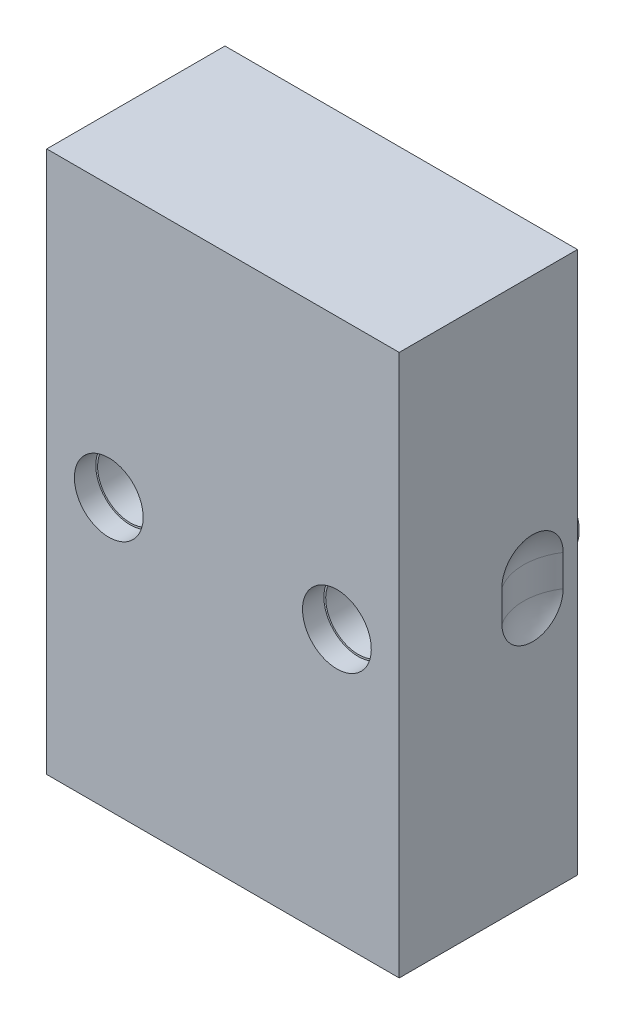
ISO-10303-21;
HEADER;
FILE_DESCRIPTION(('STEP AP214'),'2;1');
FILE_NAME('part.step','',(''),(''),'','','');
FILE_SCHEMA(('AUTOMOTIVE_DESIGN { 1 0 10303 214 1 1 1 1 }'));
ENDSEC;
DATA;
#1=APPLICATION_CONTEXT('core data for automotive mechanical design processes');
#2=APPLICATION_PROTOCOL_DEFINITION('international standard','automotive_design',2000,#1);
#3=PRODUCT_CONTEXT('',#1,'mechanical');
#4=PRODUCT('Part','Part','',(#3));
#5=PRODUCT_RELATED_PRODUCT_CATEGORY('part','',(#4));
#6=PRODUCT_DEFINITION_FORMATION('','',#4);
#7=PRODUCT_DEFINITION_CONTEXT('part definition',#1,'design');
#8=PRODUCT_DEFINITION('design','',#6,#7);
#9=PRODUCT_DEFINITION_SHAPE('','',#8);
#10=(LENGTH_UNIT() NAMED_UNIT(*) SI_UNIT(.MILLI.,.METRE.));
#11=(NAMED_UNIT(*) PLANE_ANGLE_UNIT() SI_UNIT($,.RADIAN.));
#12=(NAMED_UNIT(*) SI_UNIT($,.STERADIAN.) SOLID_ANGLE_UNIT());
#13=UNCERTAINTY_MEASURE_WITH_UNIT(LENGTH_MEASURE(1.E-05),#10,'distance_accuracy_value','');
#14=(GEOMETRIC_REPRESENTATION_CONTEXT(3) GLOBAL_UNCERTAINTY_ASSIGNED_CONTEXT((#13)) GLOBAL_UNIT_ASSIGNED_CONTEXT((#10,
#11,#12)) REPRESENTATION_CONTEXT('',''));
#15=CARTESIAN_POINT('',(0.,0.,0.));
#16=DIRECTION('',(0.,0.,1.));
#17=DIRECTION('',(1.,0.,0.));
#18=AXIS2_PLACEMENT_3D('',#15,#16,#17);
#19=CARTESIAN_POINT('',(31.9999999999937,6.98303303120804E-12,7.));
#20=DIRECTION('',(0.,0.,-1.));
#21=DIRECTION('',(0.,1.,0.));
#22=AXIS2_PLACEMENT_3D('',#19,#20,#21);
#23=CYLINDRICAL_SURFACE('',#22,2.6);
#24=CARTESIAN_POINT('',(31.9999999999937,6.98308201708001E-12,6.59999999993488));
#25=DIRECTION('',(0.,0.,1.));
#26=DIRECTION('',(0.,-1.,0.));
#27=AXIS2_PLACEMENT_3D('',#24,#25,#26);
#28=CIRCLE('',#27,2.59999999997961);
#29=CARTESIAN_POINT('',(31.9999999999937,-2.59999999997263,6.59999999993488));
#30=VERTEX_POINT('',#29);
#31=EDGE_CURVE('E142',#30,#30,#28,.T.);
#32=ORIENTED_EDGE('',*,*,#31,.T.);
#33=EDGE_LOOP('',(#32));
#34=FACE_BOUND('',#33,.T.);
#35=CARTESIAN_POINT('',(31.9999999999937,6.98389028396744E-12,0.));
#36=DIRECTION('',(0.,0.,-1.));
#37=DIRECTION('',(0.,1.,0.));
#38=AXIS2_PLACEMENT_3D('',#35,#36,#37);
#39=CIRCLE('',#38,2.6);
#40=CARTESIAN_POINT('',(31.9999999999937,2.60000000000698,0.));
#41=VERTEX_POINT('',#40);
#42=EDGE_CURVE('E18',#41,#41,#39,.F.);
#43=ORIENTED_EDGE('',*,*,#42,.F.);
#44=EDGE_LOOP('',(#43));
#45=FACE_BOUND('',#44,.T.);
#46=ADVANCED_FACE('F14',(#34,#45),#23,.F.);
#47=CARTESIAN_POINT('',(-6.23323614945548E-12,5.54116962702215E-12,7.));
#48=DIRECTION('',(0.,0.,-1.));
#49=DIRECTION('',(0.,1.,0.));
#50=AXIS2_PLACEMENT_3D('',#47,#48,#49);
#51=CYLINDRICAL_SURFACE('',#50,2.6);
#52=CARTESIAN_POINT('',(-6.23323614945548E-12,5.54121861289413E-12,6.59999999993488));
#53=DIRECTION('',(0.,0.,1.));
#54=DIRECTION('',(0.,-1.,0.));
#55=AXIS2_PLACEMENT_3D('',#52,#53,#54);
#56=CIRCLE('',#55,2.59999999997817);
#57=CARTESIAN_POINT('',(-6.23339535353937E-12,-2.59999999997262,6.59999999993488));
#58=VERTEX_POINT('',#57);
#59=EDGE_CURVE('E145',#58,#58,#56,.T.);
#60=ORIENTED_EDGE('',*,*,#59,.T.);
#61=EDGE_LOOP('',(#60));
#62=FACE_BOUND('',#61,.T.);
#63=CARTESIAN_POINT('',(-6.23323614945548E-12,5.54202687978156E-12,0.));
#64=DIRECTION('',(0.,0.,-1.));
#65=DIRECTION('',(0.,1.,0.));
#66=AXIS2_PLACEMENT_3D('',#63,#64,#65);
#67=CIRCLE('',#66,2.6);
#68=CARTESIAN_POINT('',(-6.23323614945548E-12,2.60000000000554,0.));
#69=VERTEX_POINT('',#68);
#70=EDGE_CURVE('E246',#69,#69,#67,.F.);
#71=ORIENTED_EDGE('',*,*,#70,.F.);
#72=EDGE_LOOP('',(#71));
#73=FACE_BOUND('',#72,.T.);
#74=ADVANCED_FACE('F256',(#62,#73),#51,.F.);
#75=CARTESIAN_POINT('',(-6.23323614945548E-12,5.54114046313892E-12,6.99999999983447));
#76=DIRECTION('',(0.,0.,1.));
#77=DIRECTION('',(0.,-1.,0.));
#78=AXIS2_PLACEMENT_3D('',#75,#76,#77);
#79=CONICAL_SURFACE('',#78,2.9999999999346,0.785398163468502);
#80=CARTESIAN_POINT('',(-6.23323614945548E-12,5.5411404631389E-12,6.99999999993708));
#81=DIRECTION('',(0.,0.,1.));
#82=DIRECTION('',(0.,-1.,0.));
#83=AXIS2_PLACEMENT_3D('',#80,#81,#82);
#84=CIRCLE('',#83,3.0000000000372);
#85=CARTESIAN_POINT('',(-6.23323614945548E-12,-3.00000000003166,6.99999999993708));
#86=VERTEX_POINT('',#85);
#87=EDGE_CURVE('E244',#86,#86,#84,.T.);
#88=ORIENTED_EDGE('',*,*,#87,.T.);
#89=EDGE_LOOP('',(#88));
#90=FACE_BOUND('',#89,.T.);
#91=ORIENTED_EDGE('',*,*,#59,.F.);
#92=EDGE_LOOP('',(#91));
#93=FACE_BOUND('',#92,.T.);
#94=ADVANCED_FACE('F263',(#90,#93),#79,.F.);
#95=CARTESIAN_POINT('',(31.9999999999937,6.98312935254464E-12,6.99999999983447));
#96=DIRECTION('',(0.,0.,1.));
#97=DIRECTION('',(0.,-1.,0.));
#98=AXIS2_PLACEMENT_3D('',#95,#96,#97);
#99=CONICAL_SURFACE('',#98,2.99999999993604,0.785398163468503);
#100=CARTESIAN_POINT('',(31.9999999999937,6.98312935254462E-12,6.99999999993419));
#101=DIRECTION('',(0.,0.,1.));
#102=DIRECTION('',(0.,-1.,0.));
#103=AXIS2_PLACEMENT_3D('',#100,#101,#102);
#104=CIRCLE('',#103,3.00000000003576);
#105=CARTESIAN_POINT('',(31.9999999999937,-3.00000000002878,6.99999999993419));
#106=VERTEX_POINT('',#105);
#107=EDGE_CURVE('E241',#106,#106,#104,.T.);
#108=ORIENTED_EDGE('',*,*,#107,.T.);
#109=EDGE_LOOP('',(#108));
#110=FACE_BOUND('',#109,.T.);
#111=ORIENTED_EDGE('',*,*,#31,.F.);
#112=EDGE_LOOP('',(#111));
#113=FACE_BOUND('',#112,.T.);
#114=ADVANCED_FACE('F269',(#110,#113),#99,.F.);
#115=CARTESIAN_POINT('',(29.4,0.,0.));
#116=DIRECTION('',(0.,0.,-1.));
#117=DIRECTION('',(0.,1.,0.));
#118=AXIS2_PLACEMENT_3D('',#115,#116,#117);
#119=PLANE('',#118);
#120=CARTESIAN_POINT('',(32.,0.,0.));
#121=DIRECTION('',(0.,0.,-1.));
#122=DIRECTION('',(0.,1.,0.));
#123=AXIS2_PLACEMENT_3D('',#120,#121,#122);
#124=CIRCLE('',#123,5.);
#125=CARTESIAN_POINT('',(32.,5.00000000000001,0.));
#126=VERTEX_POINT('',#125);
#127=EDGE_CURVE('E238',#126,#126,#124,.F.);
#128=ORIENTED_EDGE('',*,*,#127,.F.);
#129=EDGE_LOOP('',(#128));
#130=FACE_BOUND('',#129,.T.);
#131=ORIENTED_EDGE('',*,*,#42,.T.);
#132=EDGE_LOOP('',(#131));
#133=FACE_BOUND('',#132,.T.);
#134=ADVANCED_FACE('F253',(#130,#133),#119,.T.);
#135=CARTESIAN_POINT('',(-2.60000000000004,0.,0.));
#136=DIRECTION('',(0.,0.,-1.));
#137=DIRECTION('',(0.,1.,0.));
#138=AXIS2_PLACEMENT_3D('',#135,#136,#137);
#139=PLANE('',#138);
#140=CARTESIAN_POINT('',(0.,0.,6.51909082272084E-12));
#141=DIRECTION('',(0.,0.,-1.));
#142=DIRECTION('',(0.,1.,0.));
#143=AXIS2_PLACEMENT_3D('',#140,#141,#142);
#144=CIRCLE('',#143,5.);
#145=CARTESIAN_POINT('',(0.,5.00000000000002,6.51970314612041E-12));
#146=VERTEX_POINT('',#145);
#147=EDGE_CURVE('E235',#146,#146,#144,.F.);
#148=ORIENTED_EDGE('',*,*,#147,.F.);
#149=EDGE_LOOP('',(#148));
#150=FACE_BOUND('',#149,.T.);
#151=ORIENTED_EDGE('',*,*,#70,.T.);
#152=EDGE_LOOP('',(#151));
#153=FACE_BOUND('',#152,.T.);
#154=ADVANCED_FACE('F276',(#150,#153),#139,.T.);
#155=CARTESIAN_POINT('',(-3.34487992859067E-12,2.65352394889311E-12,7.));
#156=DIRECTION('',(0.,0.,-1.));
#157=DIRECTION('',(0.,1.,0.));
#158=AXIS2_PLACEMENT_3D('',#155,#156,#157);
#159=PLANE('',#158);
#160=CARTESIAN_POINT('',(-3.34487992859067E-12,2.65352394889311E-12,7.));
#161=DIRECTION('',(0.,0.,1.));
#162=DIRECTION('',(0.,-1.,0.));
#163=AXIS2_PLACEMENT_3D('',#160,#161,#162);
#164=CIRCLE('',#163,4.57);
#165=CARTESIAN_POINT('',(-3.34487992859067E-12,-4.56999999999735,7.));
#166=VERTEX_POINT('',#165);
#167=EDGE_CURVE('E232',#166,#166,#164,.T.);
#168=ORIENTED_EDGE('',*,*,#167,.T.);
#169=EDGE_LOOP('',(#168));
#170=FACE_BOUND('',#169,.T.);
#171=ORIENTED_EDGE('',*,*,#87,.F.);
#172=EDGE_LOOP('',(#171));
#173=FACE_BOUND('',#172,.T.);
#174=ADVANCED_FACE('F280',(#170,#173),#159,.F.);
#175=CARTESIAN_POINT('',(31.9999999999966,2.65156451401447E-12,7.));
#176=DIRECTION('',(0.,0.,-1.));
#177=DIRECTION('',(0.,1.,0.));
#178=AXIS2_PLACEMENT_3D('',#175,#176,#177);
#179=PLANE('',#178);
#180=CARTESIAN_POINT('',(31.9999999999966,2.65156451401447E-12,7.));
#181=DIRECTION('',(0.,0.,1.));
#182=DIRECTION('',(0.,-1.,0.));
#183=AXIS2_PLACEMENT_3D('',#180,#181,#182);
#184=CIRCLE('',#183,4.57);
#185=CARTESIAN_POINT('',(31.9999999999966,-4.56999999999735,7.));
#186=VERTEX_POINT('',#185);
#187=EDGE_CURVE('E81',#186,#186,#184,.T.);
#188=ORIENTED_EDGE('',*,*,#187,.T.);
#189=EDGE_LOOP('',(#188));
#190=FACE_BOUND('',#189,.T.);
#191=ORIENTED_EDGE('',*,*,#107,.F.);
#192=EDGE_LOOP('',(#191));
#193=FACE_BOUND('',#192,.T.);
#194=ADVANCED_FACE('F284',(#190,#193),#179,.F.);
#195=CARTESIAN_POINT('',(32.,0.,4.));
#196=DIRECTION('',(0.,0.,-1.));
#197=DIRECTION('',(0.,1.,0.));
#198=AXIS2_PLACEMENT_3D('',#195,#196,#197);
#199=CYLINDRICAL_SURFACE('',#198,5.);
#200=CARTESIAN_POINT('',(32.,0.,4.00000000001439));
#201=DIRECTION('',(0.,0.,-1.));
#202=DIRECTION('',(0.,1.,0.));
#203=AXIS2_PLACEMENT_3D('',#200,#201,#202);
#204=CIRCLE('',#203,5.);
#205=CARTESIAN_POINT('',(32.,5.00000000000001,4.00000000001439));
#206=VERTEX_POINT('',#205);
#207=EDGE_CURVE('E221',#206,#206,#204,.F.);
#208=ORIENTED_EDGE('',*,*,#207,.F.);
#209=EDGE_LOOP('',(#208));
#210=FACE_BOUND('',#209,.T.);
#211=ORIENTED_EDGE('',*,*,#127,.T.);
#212=EDGE_LOOP('',(#211));
#213=FACE_BOUND('',#212,.T.);
#214=ADVANCED_FACE('F288',(#210,#213),#199,.T.);
#215=CARTESIAN_POINT('',(0.,0.,4.));
#216=DIRECTION('',(0.,0.,-1.));
#217=DIRECTION('',(0.,1.,0.));
#218=AXIS2_PLACEMENT_3D('',#215,#216,#217);
#219=CYLINDRICAL_SURFACE('',#218,5.);
#220=CARTESIAN_POINT('',(0.,0.,3.99999999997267));
#221=DIRECTION('',(0.,0.,-1.));
#222=DIRECTION('',(0.,1.,0.));
#223=AXIS2_PLACEMENT_3D('',#220,#221,#222);
#224=CIRCLE('',#223,5.);
#225=CARTESIAN_POINT('',(0.,5.00000000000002,3.99999999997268));
#226=VERTEX_POINT('',#225);
#227=EDGE_CURVE('E211',#226,#226,#224,.F.);
#228=ORIENTED_EDGE('',*,*,#227,.F.);
#229=EDGE_LOOP('',(#228));
#230=FACE_BOUND('',#229,.T.);
#231=ORIENTED_EDGE('',*,*,#147,.T.);
#232=EDGE_LOOP('',(#231));
#233=FACE_BOUND('',#232,.T.);
#234=ADVANCED_FACE('F292',(#230,#233),#219,.T.);
#235=CARTESIAN_POINT('',(-3.34487992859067E-12,2.65156451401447E-12,23.));
#236=DIRECTION('',(0.,0.,1.));
#237=DIRECTION('',(0.,-1.,0.));
#238=AXIS2_PLACEMENT_3D('',#235,#236,#237);
#239=CYLINDRICAL_SURFACE('',#238,4.57);
#240=ORIENTED_EDGE('',*,*,#167,.F.);
#241=EDGE_LOOP('',(#240));
#242=FACE_BOUND('',#241,.T.);
#243=CARTESIAN_POINT('',(-3.34487992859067E-12,2.65119712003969E-12,25.9999994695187));
#244=DIRECTION('',(0.,0.,1.));
#245=DIRECTION('',(0.,-1.,0.));
#246=AXIS2_PLACEMENT_3D('',#243,#244,#245);
#247=CIRCLE('',#246,4.57);
#248=CARTESIAN_POINT('',(-3.34487992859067E-12,-4.56999999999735,25.9999994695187));
#249=VERTEX_POINT('',#248);
#250=EDGE_CURVE('E208',#249,#249,#247,.T.);
#251=ORIENTED_EDGE('',*,*,#250,.T.);
#252=EDGE_LOOP('',(#251));
#253=FACE_BOUND('',#252,.T.);
#254=ADVANCED_FACE('F296',(#242,#253),#239,.F.);
#255=CARTESIAN_POINT('',(31.9999999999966,2.64960507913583E-12,23.));
#256=DIRECTION('',(0.,0.,1.));
#257=DIRECTION('',(0.,-1.,0.));
#258=AXIS2_PLACEMENT_3D('',#255,#256,#257);
#259=CYLINDRICAL_SURFACE('',#258,4.57);
#260=ORIENTED_EDGE('',*,*,#187,.F.);
#261=EDGE_LOOP('',(#260));
#262=FACE_BOUND('',#261,.T.);
#263=CARTESIAN_POINT('',(31.9999999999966,2.64923768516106E-12,25.9999994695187));
#264=DIRECTION('',(0.,0.,1.));
#265=DIRECTION('',(0.,-1.,0.));
#266=AXIS2_PLACEMENT_3D('',#263,#264,#265);
#267=CIRCLE('',#266,4.57);
#268=CARTESIAN_POINT('',(31.9999999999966,-4.56999999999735,25.9999994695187));
#269=VERTEX_POINT('',#268);
#270=EDGE_CURVE('E96',#269,#269,#267,.T.);
#271=ORIENTED_EDGE('',*,*,#270,.T.);
#272=EDGE_LOOP('',(#271));
#273=FACE_BOUND('',#272,.T.);
#274=ADVANCED_FACE('F300',(#262,#273),#259,.F.);
#275=CARTESIAN_POINT('',(-15.33,-2.20429583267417,10.2999993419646));
#276=DIRECTION('',(0.356578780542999,0.367960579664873,0.858752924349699));
#277=DIRECTION('',(0.818072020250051,-0.56691537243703,-0.0967736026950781));
#278=AXIS2_PLACEMENT_3D('',#275,#276,#277);
#279=SPHERICAL_SURFACE('',#278,7.9);
#280=CARTESIAN_POINT('',(-15.33,-2.20429583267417,10.2999993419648));
#281=DIRECTION('',(0.,-1.,0.));
#282=DIRECTION('',(0.,0.,-1.));
#283=AXIS2_PLACEMENT_3D('',#280,#281,#282);
#284=CIRCLE('',#283,7.9);
#285=CARTESIAN_POINT('',(-8.7,-2.20429583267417,14.5957065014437));
#286=VERTEX_POINT('',#285);
#287=CARTESIAN_POINT('',(-8.7,-2.20429583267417,6.0042921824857));
#288=VERTEX_POINT('',#287);
#289=EDGE_CURVE('E73',#286,#288,#284,.F.);
#290=ORIENTED_EDGE('',*,*,#289,.T.);
#291=CARTESIAN_POINT('',(-8.7,-2.20429583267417,6.0042921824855));
#292=CARTESIAN_POINT('',(-8.7,-2.32511395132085,6.00427919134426));
#293=CARTESIAN_POINT('',(-8.7,-2.44593020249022,6.00938870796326));
#294=CARTESIAN_POINT('',(-8.7,-2.68669834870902,6.0297589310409));
#295=CARTESIAN_POINT('',(-8.7,-2.80665028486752,6.04501915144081));
#296=CARTESIAN_POINT('',(-8.7,-3.04475719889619,6.08558271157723));
#297=CARTESIAN_POINT('',(-8.7,-3.16291338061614,6.11087898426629));
#298=CARTESIAN_POINT('',(-8.7,-3.39667451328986,6.17133061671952));
#299=CARTESIAN_POINT('',(-8.7,-3.51227949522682,6.20648585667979));
#300=CARTESIAN_POINT('',(-8.7,-3.74015097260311,6.28641834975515));
#301=CARTESIAN_POINT('',(-8.69999999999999,-3.85241650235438,6.33119835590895));
#302=CARTESIAN_POINT('',(-8.70000000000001,-4.07281728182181,6.43007414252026));
#303=CARTESIAN_POINT('',(-8.70000000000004,-4.18095099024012,6.48417335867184));
#304=CARTESIAN_POINT('',(-8.69999999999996,-4.39221521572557,6.60125821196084));
#305=CARTESIAN_POINT('',(-8.69999999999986,-4.49534852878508,6.66423880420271));
#306=CARTESIAN_POINT('',(-8.70000000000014,-4.69598170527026,6.79868682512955));
#307=CARTESIAN_POINT('',(-8.70000000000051,-4.79347947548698,6.87015737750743));
#308=CARTESIAN_POINT('',(-8.70000000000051,-4.98207424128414,7.02103229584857));
#309=CARTESIAN_POINT('',(-8.70000000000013,-5.0731734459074,7.10043390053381));
#310=CARTESIAN_POINT('',(-8.69999999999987,-5.24839335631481,7.26665815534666));
#311=CARTESIAN_POINT('',(-8.69999999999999,-5.33251147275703,7.35348353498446));
#312=CARTESIAN_POINT('',(-8.7,-5.49311603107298,7.53389306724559));
#313=CARTESIAN_POINT('',(-8.69999999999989,-5.56960412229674,7.62747575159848));
#314=CARTESIAN_POINT('',(-8.70000000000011,-5.71445248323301,7.82078712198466));
#315=CARTESIAN_POINT('',(-8.70000000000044,-5.78280974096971,7.92051806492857));
#316=CARTESIAN_POINT('',(-8.70000000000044,-5.91085088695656,8.12534291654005));
#317=CARTESIAN_POINT('',(-8.70000000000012,-5.97053834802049,8.23043459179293));
#318=CARTESIAN_POINT('',(-8.69999999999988,-6.08086973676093,8.44531165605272));
#319=CARTESIAN_POINT('',(-8.69999999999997,-6.13151031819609,8.5550987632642));
#320=CARTESIAN_POINT('',(-8.70000000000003,-6.22334078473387,8.77850114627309));
#321=CARTESIAN_POINT('',(-8.70000000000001,-6.26453474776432,8.89211474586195));
#322=CARTESIAN_POINT('',(-8.69999999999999,-6.33722068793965,9.12245023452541));
#323=CARTESIAN_POINT('',(-8.7,-6.36870908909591,9.23917325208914));
#324=CARTESIAN_POINT('',(-8.7,-6.42173046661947,9.47481749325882));
#325=CARTESIAN_POINT('',(-8.7,-6.44326679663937,9.59373796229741));
#326=CARTESIAN_POINT('',(-8.7,-6.47625238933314,9.83301192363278));
#327=CARTESIAN_POINT('',(-8.7,-6.48769814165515,9.95336589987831));
#328=CARTESIAN_POINT('',(-8.7,-6.50040744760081,10.194592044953));
#329=CARTESIAN_POINT('',(-8.7,-6.5016725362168,10.3154641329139));
#330=CARTESIAN_POINT('',(-8.7,-6.49401556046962,10.5568852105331));
#331=CARTESIAN_POINT('',(-8.7,-6.48509349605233,10.6774342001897));
#332=CARTESIAN_POINT('',(-8.7,-6.45712333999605,10.9173717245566));
#333=CARTESIAN_POINT('',(-8.7,-6.43807358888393,11.0367600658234));
#334=CARTESIAN_POINT('',(-8.7,-6.38999089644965,11.2734659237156));
#335=CARTESIAN_POINT('',(-8.7,-6.36096142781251,11.3907841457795));
#336=CARTESIAN_POINT('',(-8.7,-6.29311212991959,11.6225997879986));
#337=CARTESIAN_POINT('',(-8.7,-6.25428883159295,11.7370961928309));
#338=CARTESIAN_POINT('',(-8.7,-6.16714916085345,11.9623691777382));
#339=CARTESIAN_POINT('',(-8.7,-6.11883628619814,12.0731471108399));
#340=CARTESIAN_POINT('',(-8.7,-6.01303082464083,12.2902830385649));
#341=CARTESIAN_POINT('',(-8.7,-5.95553462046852,12.3966392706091));
#342=CARTESIAN_POINT('',(-8.7,-5.83180799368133,12.6040905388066));
#343=CARTESIAN_POINT('',(-8.7,-5.76558080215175,12.7051875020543));
#344=CARTESIAN_POINT('',(-8.7,-5.62482392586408,12.9014753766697));
#345=CARTESIAN_POINT('',(-8.7,-5.55029159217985,12.9966643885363));
#346=CARTESIAN_POINT('',(-8.7,-5.39350072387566,13.1803901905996));
#347=CARTESIAN_POINT('',(-8.7,-5.31124505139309,13.2689294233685));
#348=CARTESIAN_POINT('',(-8.7,-5.13954860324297,13.4387852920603));
#349=CARTESIAN_POINT('',(-8.7,-5.0501061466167,13.5201002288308));
#350=CARTESIAN_POINT('',(-8.7,-4.86472313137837,13.6748774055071));
#351=CARTESIAN_POINT('',(-8.7,-4.76878498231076,13.7483425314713));
#352=CARTESIAN_POINT('',(-8.7,-4.57099465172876,13.8869802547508));
#353=CARTESIAN_POINT('',(-8.7,-4.46913844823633,13.9521471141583));
#354=CARTESIAN_POINT('',(-8.7,-4.26033524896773,14.0736430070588));
#355=CARTESIAN_POINT('',(-8.7,-4.15339014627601,14.1299752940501));
#356=CARTESIAN_POINT('',(-8.7,-3.93502758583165,14.2334813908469));
#357=CARTESIAN_POINT('',(-8.7,-3.82360584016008,14.2806461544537));
#358=CARTESIAN_POINT('',(-8.7,-3.59722389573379,14.3653963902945));
#359=CARTESIAN_POINT('',(-8.7,-3.48226504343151,14.4029854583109));
#360=CARTESIAN_POINT('',(-8.7,-3.24971945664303,14.468303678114));
#361=CARTESIAN_POINT('',(-8.7,-3.13213575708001,14.496043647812));
#362=CARTESIAN_POINT('',(-8.7,-2.89509682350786,14.5415140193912));
#363=CARTESIAN_POINT('',(-8.7,-2.77564253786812,14.5592493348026));
#364=CARTESIAN_POINT('',(-8.7,-2.58065620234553,14.5798529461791));
#365=CARTESIAN_POINT('',(-8.7,-2.50543627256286,14.5858018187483));
#366=CARTESIAN_POINT('',(-8.7,-2.35491211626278,14.5937257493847));
#367=CARTESIAN_POINT('',(-8.7,-2.27960823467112,14.5957073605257));
#368=CARTESIAN_POINT('',(-8.7,-2.20429583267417,14.5957065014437));
#369=B_SPLINE_CURVE_WITH_KNOTS('',3,(#291,#292,#293,#294,#295,#296,#297,#298,#299,#300,#301,
#302,#303,#304,#305,#306,#307,#308,#309,#310,#311,#312,#313,#314,#315,#316,#317,#318,#319,#320,
#321,#322,#323,#324,#325,#326,#327,#328,#329,#330,#331,#332,#333,#334,#335,#336,#337,#338,#339,
#340,#341,#342,#343,#344,#345,#346,#347,#348,#349,#350,#351,#352,#353,#354,#355,#356,#357,#358,
#359,#360,#361,#362,#363,#364,#365,#366,#367,#368),.UNSPECIFIED.,.F.,.F.,(4,2,2,2,2,2,2,2,2,2,2,
2,2,2,2,2,2,2,2,2,2,2,2,2,2,2,2,2,2,2,2,2,2,2,2,2,2,2,4),(0.,0.362343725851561,
0.724670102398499,1.0867417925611,1.4488090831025,1.81098007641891,2.17328487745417,
2.53538470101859,2.89761816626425,3.25972595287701,3.62196745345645,3.98413047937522,
4.34642724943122,4.70857429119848,5.07085500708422,5.43297903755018,5.79523633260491,
6.15737146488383,6.51963252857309,6.88183897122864,7.24404541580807,7.60631122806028,
7.96845110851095,8.33071944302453,8.69285449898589,9.0551325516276,9.41727691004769,
9.77953710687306,10.1416635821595,10.503875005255,10.86595279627,11.2282796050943,
11.5904726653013,11.9530213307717,12.3154336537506,12.6774466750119,13.0392817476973,
13.2655500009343,13.4914441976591),.UNSPECIFIED.);
#370=EDGE_CURVE('E79',#288,#286,#369,.T.);
#371=ORIENTED_EDGE('',*,*,#370,.T.);
#372=EDGE_LOOP('',(#290,#371));
#373=FACE_BOUND('',#372,.T.);
#374=ADVANCED_FACE('F78',(#373),#279,.F.);
#375=CARTESIAN_POINT('',(-15.33,-26.004661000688,10.2999993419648));
#376=DIRECTION('',(0.,-1.,0.));
#377=DIRECTION('',(0.,0.,-1.));
#378=AXIS2_PLACEMENT_3D('',#375,#376,#377);
#379=CYLINDRICAL_SURFACE('',#378,7.9);
#380=DIRECTION('',(0.,1.,0.));
#381=VECTOR('',#380,1.);
#382=CARTESIAN_POINT('',(-8.7,1.00135803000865E-06,14.5957065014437));
#383=LINE('',#382,#381);
#384=CARTESIAN_POINT('',(-8.7,2.20428984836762,14.5957065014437));
#385=VERTEX_POINT('',#384);
#386=EDGE_CURVE('E89',#286,#385,#383,.T.);
#387=ORIENTED_EDGE('',*,*,#386,.T.);
#388=CARTESIAN_POINT('',(-15.33,2.20428984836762,10.2999993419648));
#389=DIRECTION('',(0.,-1.,0.));
#390=DIRECTION('',(0.,0.,-1.));
#391=AXIS2_PLACEMENT_3D('',#388,#389,#390);
#392=CIRCLE('',#391,7.9);
#393=CARTESIAN_POINT('',(-8.7,2.20428984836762,6.0042921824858));
#394=VERTEX_POINT('',#393);
#395=EDGE_CURVE('E80',#385,#394,#392,.F.);
#396=ORIENTED_EDGE('',*,*,#395,.T.);
#397=DIRECTION('',(0.,1.,0.));
#398=VECTOR('',#397,1.);
#399=CARTESIAN_POINT('',(-8.7,1.00135803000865E-06,6.00429218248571));
#400=LINE('',#399,#398);
#401=EDGE_CURVE('E87',#394,#288,#400,.F.);
#402=ORIENTED_EDGE('',*,*,#401,.T.);
#403=ORIENTED_EDGE('',*,*,#289,.F.);
#404=EDGE_LOOP('',(#387,#396,#402,#403));
#405=FACE_BOUND('',#404,.T.);
#406=ADVANCED_FACE('F91',(#405),#379,.F.);
#407=CARTESIAN_POINT('',(-15.33,2.20428984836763,10.2999993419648));
#408=DIRECTION('',(0.356578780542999,0.367960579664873,0.858752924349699));
#409=DIRECTION('',(0.818072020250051,-0.56691537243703,-0.0967736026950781));
#410=AXIS2_PLACEMENT_3D('',#407,#408,#409);
#411=SPHERICAL_SURFACE('',#410,7.9);
#412=ORIENTED_EDGE('',*,*,#395,.F.);
#413=CARTESIAN_POINT('',(-8.7,2.20428984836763,14.5957065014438));
#414=CARTESIAN_POINT('',(-8.7,2.32510796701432,14.5957194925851));
#415=CARTESIAN_POINT('',(-8.7,2.4459242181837,14.5906099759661));
#416=CARTESIAN_POINT('',(-8.7,2.68669236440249,14.5702397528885));
#417=CARTESIAN_POINT('',(-8.7,2.80664430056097,14.5549795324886));
#418=CARTESIAN_POINT('',(-8.7,3.04475121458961,14.5144159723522));
#419=CARTESIAN_POINT('',(-8.7,3.16290739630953,14.4891196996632));
#420=CARTESIAN_POINT('',(-8.7,3.39666852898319,14.4286680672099));
#421=CARTESIAN_POINT('',(-8.7,3.51227351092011,14.3935128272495));
#422=CARTESIAN_POINT('',(-8.7,3.7401449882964,14.3135803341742));
#423=CARTESIAN_POINT('',(-8.7,3.85241051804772,14.2688003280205));
#424=CARTESIAN_POINT('',(-8.7,4.07281129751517,14.1699245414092));
#425=CARTESIAN_POINT('',(-8.7,4.18094500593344,14.1158253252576));
#426=CARTESIAN_POINT('',(-8.7,4.39220923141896,13.9987404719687));
#427=CARTESIAN_POINT('',(-8.7,4.49534254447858,13.9357598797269));
#428=CARTESIAN_POINT('',(-8.7,4.69597572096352,13.8013118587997));
#429=CARTESIAN_POINT('',(-8.7,4.79347349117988,13.7298413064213));
#430=CARTESIAN_POINT('',(-8.7,4.98206825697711,13.5789663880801));
#431=CARTESIAN_POINT('',(-8.7,5.0731674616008,13.4995647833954));
#432=CARTESIAN_POINT('',(-8.7,5.24838737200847,13.3333405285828));
#433=CARTESIAN_POINT('',(-8.7,5.33250548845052,13.2465151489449));
#434=CARTESIAN_POINT('',(-8.7,5.49311004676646,13.0661056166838));
#435=CARTESIAN_POINT('',(-8.7,5.56959813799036,12.972522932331));
#436=CARTESIAN_POINT('',(-8.7,5.71444649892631,12.7792115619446));
#437=CARTESIAN_POINT('',(-8.7,5.78280375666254,12.6794806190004));
#438=CARTESIAN_POINT('',(-8.7,5.91084490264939,12.4746557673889));
#439=CARTESIAN_POINT('',(-8.7,5.97053236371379,12.3695640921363));
#440=CARTESIAN_POINT('',(-8.7,6.08086375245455,12.1546870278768));
#441=CARTESIAN_POINT('',(-8.7,6.13150433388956,12.0448999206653));
#442=CARTESIAN_POINT('',(-8.7,6.22333480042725,11.8214975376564));
#443=CARTESIAN_POINT('',(-8.7,6.26452876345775,11.7078839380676));
#444=CARTESIAN_POINT('',(-8.7,6.33721470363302,11.4775484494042));
#445=CARTESIAN_POINT('',(-8.7,6.36870310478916,11.3608254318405));
#446=CARTESIAN_POINT('',(-8.7,6.42172448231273,11.1251811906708));
#447=CARTESIAN_POINT('',(-8.7,6.44326081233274,11.0062607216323));
#448=CARTESIAN_POINT('',(-8.7,6.47624640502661,10.7669867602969));
#449=CARTESIAN_POINT('',(-8.7,6.48769215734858,10.6466327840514));
#450=CARTESIAN_POINT('',(-8.7,6.50040146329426,10.4054066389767));
#451=CARTESIAN_POINT('',(-8.7,6.5016665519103,10.2845345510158));
#452=CARTESIAN_POINT('',(-8.7,6.49400957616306,10.0431134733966));
#453=CARTESIAN_POINT('',(-8.7,6.48508751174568,9.92256448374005));
#454=CARTESIAN_POINT('',(-8.7,6.4571173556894,9.68262695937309));
#455=CARTESIAN_POINT('',(-8.7,6.43806760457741,9.56323861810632));
#456=CARTESIAN_POINT('',(-8.7,6.38998491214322,9.32653276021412));
#457=CARTESIAN_POINT('',(-8.7,6.36095544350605,9.20921453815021));
#458=CARTESIAN_POINT('',(-8.7,6.29310614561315,8.9773988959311));
#459=CARTESIAN_POINT('',(-8.7,6.25428284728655,8.86290249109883));
#460=CARTESIAN_POINT('',(-8.7,6.167143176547,8.63762950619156));
#461=CARTESIAN_POINT('',(-8.7,6.1188303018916,8.52685157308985));
#462=CARTESIAN_POINT('',(-8.7,6.01302484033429,8.30971564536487));
#463=CARTESIAN_POINT('',(-8.7,5.9555286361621,8.20335941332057));
#464=CARTESIAN_POINT('',(-8.7,5.83180200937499,7.99590814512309));
#465=CARTESIAN_POINT('',(-8.7,5.76557481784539,7.89481118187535));
#466=CARTESIAN_POINT('',(-8.7,5.62481794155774,7.69852330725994));
#467=CARTESIAN_POINT('',(-8.7,5.55028560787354,7.60333429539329));
#468=CARTESIAN_POINT('',(-8.7,5.39349473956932,7.41960849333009));
#469=CARTESIAN_POINT('',(-8.7,5.31123906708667,7.33106926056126));
#470=CARTESIAN_POINT('',(-8.7,5.13954261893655,7.16121339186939));
#471=CARTESIAN_POINT('',(-8.7,5.05010016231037,7.07989845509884));
#472=CARTESIAN_POINT('',(-8.7,4.8647171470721,6.92512127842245));
#473=CARTESIAN_POINT('',(-8.7,4.76877899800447,6.85165615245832));
#474=CARTESIAN_POINT('',(-8.7,4.57098866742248,6.71301842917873));
#475=CARTESIAN_POINT('',(-8.7,4.46913246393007,6.64785156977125));
#476=CARTESIAN_POINT('',(-8.7,4.26032926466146,6.52635567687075));
#477=CARTESIAN_POINT('',(-8.7,4.15338416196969,6.47002338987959));
#478=CARTESIAN_POINT('',(-8.7,3.93502160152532,6.36651729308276));
#479=CARTESIAN_POINT('',(-8.7,3.8235998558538,6.3193525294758));
#480=CARTESIAN_POINT('',(-8.7,3.59721791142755,6.23460229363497));
#481=CARTESIAN_POINT('',(-8.7,3.48225905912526,6.19701322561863));
#482=CARTESIAN_POINT('',(-8.7,3.24971347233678,6.13169500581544));
#483=CARTESIAN_POINT('',(-8.7,3.13212977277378,6.1039550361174));
#484=CARTESIAN_POINT('',(-8.7,2.89509083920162,6.05848466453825));
#485=CARTESIAN_POINT('',(-8.7,2.77563655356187,6.040749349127));
#486=CARTESIAN_POINT('',(-8.7,2.58065021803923,6.02014573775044));
#487=CARTESIAN_POINT('',(-8.7,2.50543028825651,6.01419686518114));
#488=CARTESIAN_POINT('',(-8.7,2.35490613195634,6.00627293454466));
#489=CARTESIAN_POINT('',(-8.7,2.27960225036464,6.00429132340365));
#490=CARTESIAN_POINT('',(-8.7,2.20428984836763,6.00429218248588));
#491=B_SPLINE_CURVE_WITH_KNOTS('',3,(#413,#414,#415,#416,#417,#418,#419,#420,#421,#422,#423,
#424,#425,#426,#427,#428,#429,#430,#431,#432,#433,#434,#435,#436,#437,#438,#439,#440,#441,#442,
#443,#444,#445,#446,#447,#448,#449,#450,#451,#452,#453,#454,#455,#456,#457,#458,#459,#460,#461,
#462,#463,#464,#465,#466,#467,#468,#469,#470,#471,#472,#473,#474,#475,#476,#477,#478,#479,#480,
#481,#482,#483,#484,#485,#486,#487,#488,#489,#490),.UNSPECIFIED.,.F.,.F.,(4,2,2,2,2,2,2,2,2,2,2,
2,2,2,2,2,2,2,2,2,2,2,2,2,2,2,2,2,2,2,2,2,2,2,2,2,2,2,4),(0.,0.362343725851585,
0.724670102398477,1.08674179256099,1.44880908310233,1.81098007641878,2.17328487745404,
2.53538470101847,2.89761816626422,3.25972595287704,3.6219674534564,3.98413047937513,
4.34642724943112,4.70857429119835,5.07085500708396,5.43297903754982,5.79523633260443,
6.15737146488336,6.5196325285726,6.88183897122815,7.24404541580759,7.6063112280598,
7.96845110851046,8.33071944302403,8.69285449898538,9.0551325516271,9.41727691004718,
9.77953710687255,10.141663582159,10.5038750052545,10.8659527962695,11.2282796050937,
11.5904726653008,11.9530213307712,12.3154336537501,12.6774466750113,13.0392817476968,
13.2655500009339,13.4914441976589),.UNSPECIFIED.);
#492=EDGE_CURVE('E108',#385,#394,#491,.T.);
#493=ORIENTED_EDGE('',*,*,#492,.T.);
#494=EDGE_LOOP('',(#412,#493));
#495=FACE_BOUND('',#494,.T.);
#496=ADVANCED_FACE('F314',(#495),#411,.F.);
#497=CARTESIAN_POINT('',(47.3750996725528,2.20429284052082,10.3));
#498=DIRECTION('',(0.356578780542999,0.367960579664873,0.858752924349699));
#499=DIRECTION('',(0.818072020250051,-0.56691537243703,-0.0967736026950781));
#500=AXIS2_PLACEMENT_3D('',#497,#498,#499);
#501=SPHERICAL_SURFACE('',#500,7.9);
#502=CARTESIAN_POINT('',(47.3750996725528,2.20429284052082,10.3));
#503=DIRECTION('',(0.,1.,0.));
#504=DIRECTION('',(0.,0.,1.));
#505=AXIS2_PLACEMENT_3D('',#502,#503,#504);
#506=CIRCLE('',#505,7.9);
#507=CARTESIAN_POINT('',(40.7450996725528,2.20429284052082,14.5957071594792));
#508=VERTEX_POINT('',#507);
#509=CARTESIAN_POINT('',(40.7450996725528,2.20429284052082,6.00429284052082));
#510=VERTEX_POINT('',#509);
#511=EDGE_CURVE('E227',#508,#510,#506,.F.);
#512=ORIENTED_EDGE('',*,*,#511,.T.);
#513=CARTESIAN_POINT('',(40.7450996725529,2.20429284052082,6.00429284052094));
#514=CARTESIAN_POINT('',(40.7450996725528,2.32511095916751,6.00427984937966));
#515=CARTESIAN_POINT('',(40.7450996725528,2.44592721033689,6.00938936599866));
#516=CARTESIAN_POINT('',(40.7450996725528,2.68669535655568,6.02975958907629));
#517=CARTESIAN_POINT('',(40.7450996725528,2.80664729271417,6.04501980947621));
#518=CARTESIAN_POINT('',(40.7450996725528,3.04475420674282,6.08558336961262));
#519=CARTESIAN_POINT('',(40.7450996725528,3.16291038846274,6.11087964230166));
#520=CARTESIAN_POINT('',(40.7450996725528,3.39667152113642,6.1713312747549));
#521=CARTESIAN_POINT('',(40.7450996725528,3.51227650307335,6.2064865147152));
#522=CARTESIAN_POINT('',(40.7450996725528,3.74014798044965,6.28641900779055));
#523=CARTESIAN_POINT('',(40.7450996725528,3.85241351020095,6.33119901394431));
#524=CARTESIAN_POINT('',(40.7450996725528,4.07281428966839,6.43007480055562));
#525=CARTESIAN_POINT('',(40.7450996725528,4.18094799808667,6.48417401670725));
#526=CARTESIAN_POINT('',(40.7450996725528,4.39221222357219,6.60125886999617));
#527=CARTESIAN_POINT('',(40.7450996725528,4.4953455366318,6.66423946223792));
#528=CARTESIAN_POINT('',(40.7450996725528,4.69597871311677,6.7986874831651));
#529=CARTESIAN_POINT('',(40.7450996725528,4.79347648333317,6.87015803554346));
#530=CARTESIAN_POINT('',(40.7450996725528,4.98207124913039,7.02103295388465));
#531=CARTESIAN_POINT('',(40.7450996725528,5.07317045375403,7.10043455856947));
#532=CARTESIAN_POINT('',(40.7450996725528,5.24839036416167,7.26665881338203));
#533=CARTESIAN_POINT('',(40.7450996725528,5.33250848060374,7.35348419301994));
#534=CARTESIAN_POINT('',(40.7450996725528,5.49311303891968,7.53389372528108));
#535=CARTESIAN_POINT('',(40.7450996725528,5.56960113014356,7.62747640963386));
#536=CARTESIAN_POINT('',(40.7450996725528,5.71444949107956,7.8207877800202));
#537=CARTESIAN_POINT('',(40.7450996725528,5.78280674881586,7.92051872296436));
#538=CARTESIAN_POINT('',(40.7450996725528,5.9108478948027,8.12534357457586));
#539=CARTESIAN_POINT('',(40.7450996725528,5.97053535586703,8.23043524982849));
#540=CARTESIAN_POINT('',(40.7450996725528,6.08086674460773,8.44531231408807));
#541=CARTESIAN_POINT('',(40.7450996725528,6.13150732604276,8.55509942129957));
#542=CARTESIAN_POINT('',(40.7450996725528,6.22333779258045,8.77850180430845));
#543=CARTESIAN_POINT('',(40.7450996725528,6.26453175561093,8.89211540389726));
#544=CARTESIAN_POINT('',(40.7450996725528,6.33721769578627,9.12245089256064));
#545=CARTESIAN_POINT('',(40.7450996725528,6.36870609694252,9.23917391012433));
#546=CARTESIAN_POINT('',(40.7450996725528,6.42172747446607,9.47481815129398));
#547=CARTESIAN_POINT('',(40.7450996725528,6.44326380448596,9.59373862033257));
#548=CARTESIAN_POINT('',(40.7450996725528,6.47624939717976,9.83301258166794));
#549=CARTESIAN_POINT('',(40.7450996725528,6.48769514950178,9.95336655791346));
#550=CARTESIAN_POINT('',(40.7450996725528,6.50040445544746,10.1945927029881));
#551=CARTESIAN_POINT('',(40.7450996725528,6.50166954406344,10.3154647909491));
#552=CARTESIAN_POINT('',(40.7450996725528,6.49401256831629,10.5568858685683));
#553=CARTESIAN_POINT('',(40.7450996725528,6.48509050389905,10.6774348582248));
#554=CARTESIAN_POINT('',(40.7450996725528,6.45712034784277,10.9173723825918));
#555=CARTESIAN_POINT('',(40.7450996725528,6.43807059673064,11.0367607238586));
#556=CARTESIAN_POINT('',(40.7450996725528,6.38998790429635,11.2734665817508));
#557=CARTESIAN_POINT('',(40.7450996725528,6.36095843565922,11.3907848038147));
#558=CARTESIAN_POINT('',(40.7450996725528,6.29310913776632,11.6226004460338));
#559=CARTESIAN_POINT('',(40.7450996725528,6.25428583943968,11.737096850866));
#560=CARTESIAN_POINT('',(40.7450996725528,6.16714616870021,11.9623698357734));
#561=CARTESIAN_POINT('',(40.7450996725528,6.11883329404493,12.0731477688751));
#562=CARTESIAN_POINT('',(40.7450996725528,6.01302783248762,12.2902836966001));
#563=CARTESIAN_POINT('',(40.7450996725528,5.9555316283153,12.3966399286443));
#564=CARTESIAN_POINT('',(40.7450996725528,5.83180500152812,12.6040911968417));
#565=CARTESIAN_POINT('',(40.7450996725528,5.76557780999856,12.7051881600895));
#566=CARTESIAN_POINT('',(40.7450996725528,5.62482093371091,12.9014760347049));
#567=CARTESIAN_POINT('',(40.7450996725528,5.55028860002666,12.9966650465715));
#568=CARTESIAN_POINT('',(40.7450996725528,5.3934977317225,13.1803908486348));
#569=CARTESIAN_POINT('',(40.7450996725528,5.31124205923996,13.2689300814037));
#570=CARTESIAN_POINT('',(40.7450996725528,5.13954561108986,13.4387859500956));
#571=CARTESIAN_POINT('',(40.7450996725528,5.05010315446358,13.520100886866));
#572=CARTESIAN_POINT('',(40.7450996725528,4.86472013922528,13.6748780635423));
#573=CARTESIAN_POINT('',(40.7450996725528,4.76878199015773,13.7483431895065));
#574=CARTESIAN_POINT('',(40.7450996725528,4.57099165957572,13.886980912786));
#575=CARTESIAN_POINT('',(40.7450996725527,4.46913545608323,13.9521477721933));
#576=CARTESIAN_POINT('',(40.7450996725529,4.26033225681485,14.0736436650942));
#577=CARTESIAN_POINT('',(40.7450996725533,4.15338715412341,14.1299759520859));
#578=CARTESIAN_POINT('',(40.7450996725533,3.9350245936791,14.2334820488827));
#579=CARTESIAN_POINT('',(40.7450996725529,3.82360284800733,14.2806468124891));
#580=CARTESIAN_POINT('',(40.7450996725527,3.59722090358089,14.3653970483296));
#581=CARTESIAN_POINT('',(40.7450996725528,3.48226205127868,14.4029861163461));
#582=CARTESIAN_POINT('',(40.7450996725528,3.24971646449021,14.4683043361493));
#583=CARTESIAN_POINT('',(40.7450996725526,3.13213276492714,14.4960443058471));
#584=CARTESIAN_POINT('',(40.745099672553,2.89509383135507,14.5415146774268));
#585=CARTESIAN_POINT('',(40.7450996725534,2.77563954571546,14.5592499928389));
#586=CARTESIAN_POINT('',(40.7450996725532,2.58065321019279,14.5798536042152));
#587=CARTESIAN_POINT('',(40.745099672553,2.50543328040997,14.585802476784));
#588=CARTESIAN_POINT('',(40.7450996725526,2.35490912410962,14.5937264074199));
#589=CARTESIAN_POINT('',(40.7450996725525,2.27960524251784,14.5957080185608));
#590=CARTESIAN_POINT('',(40.7450996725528,2.20429284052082,14.5957071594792));
#591=B_SPLINE_CURVE_WITH_KNOTS('',3,(#513,#514,#515,#516,#517,#518,#519,#520,#521,#522,#523,
#524,#525,#526,#527,#528,#529,#530,#531,#532,#533,#534,#535,#536,#537,#538,#539,#540,#541,#542,
#543,#544,#545,#546,#547,#548,#549,#550,#551,#552,#553,#554,#555,#556,#557,#558,#559,#560,#561,
#562,#563,#564,#565,#566,#567,#568,#569,#570,#571,#572,#573,#574,#575,#576,#577,#578,#579,#580,
#581,#582,#583,#584,#585,#586,#587,#588,#589,#590),.UNSPECIFIED.,.F.,.F.,(4,2,2,2,2,2,2,2,2,2,2,
2,2,2,2,2,2,2,2,2,2,2,2,2,2,2,2,2,2,2,2,2,2,2,2,2,2,2,4),(0.,0.362343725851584,
0.724670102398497,1.08674179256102,1.44880908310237,1.81098007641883,2.17328487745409,
2.53538470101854,2.8976181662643,3.2597259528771,3.62196745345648,3.98413047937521,
4.3464272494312,4.70857429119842,5.07085500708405,5.43297903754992,5.79523633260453,
6.15737146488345,6.51963252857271,6.88183897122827,7.24404541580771,7.60631122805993,
7.9684511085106,8.33071944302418,8.69285449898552,9.05513255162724,9.41727691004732,
9.7795371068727,10.1416635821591,10.5038750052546,10.8659527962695,11.2282796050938,
11.5904726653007,11.9530213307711,12.31543365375,12.6774466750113,13.0392817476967,
13.265550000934,13.4914441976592),.UNSPECIFIED.);
#592=EDGE_CURVE('E113',#510,#508,#591,.T.);
#593=ORIENTED_EDGE('',*,*,#592,.T.);
#594=EDGE_LOOP('',(#512,#593));
#595=FACE_BOUND('',#594,.T.);
#596=ADVANCED_FACE('F317',(#595),#501,.F.);
#597=CARTESIAN_POINT('',(47.3750996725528,-26.0046580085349,10.3));
#598=DIRECTION('',(0.,1.,0.));
#599=DIRECTION('',(0.,0.,1.));
#600=AXIS2_PLACEMENT_3D('',#597,#598,#599);
#601=CYLINDRICAL_SURFACE('',#600,7.9);
#602=DIRECTION('',(0.,-1.,0.));
#603=VECTOR('',#602,1.);
#604=CARTESIAN_POINT('',(40.7450996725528,0.,6.00429284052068));
#605=LINE('',#604,#603);
#606=CARTESIAN_POINT('',(40.7450996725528,-2.20429284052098,6.00429284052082));
#607=VERTEX_POINT('',#606);
#608=EDGE_CURVE('E114',#607,#510,#605,.F.);
#609=ORIENTED_EDGE('',*,*,#608,.T.);
#610=ORIENTED_EDGE('',*,*,#511,.F.);
#611=DIRECTION('',(0.,-1.,0.));
#612=VECTOR('',#611,1.);
#613=CARTESIAN_POINT('',(40.7450996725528,0.,14.5957071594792));
#614=LINE('',#613,#612);
#615=CARTESIAN_POINT('',(40.7450996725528,-2.20429284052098,14.5957071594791));
#616=VERTEX_POINT('',#615);
#617=EDGE_CURVE('E109',#508,#616,#614,.T.);
#618=ORIENTED_EDGE('',*,*,#617,.T.);
#619=CARTESIAN_POINT('',(47.3750996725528,-2.20429284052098,10.3));
#620=DIRECTION('',(0.,1.,0.));
#621=DIRECTION('',(0.,0.,1.));
#622=AXIS2_PLACEMENT_3D('',#619,#620,#621);
#623=CIRCLE('',#622,7.9);
#624=EDGE_CURVE('E224',#616,#607,#623,.F.);
#625=ORIENTED_EDGE('',*,*,#624,.T.);
#626=EDGE_LOOP('',(#609,#610,#618,#625));
#627=FACE_BOUND('',#626,.T.);
#628=ADVANCED_FACE('F337',(#627),#601,.F.);
#629=CARTESIAN_POINT('',(47.3750996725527,-2.20429284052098,10.2999999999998));
#630=DIRECTION('',(0.356578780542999,0.367960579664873,0.858752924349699));
#631=DIRECTION('',(0.818072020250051,-0.56691537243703,-0.0967736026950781));
#632=AXIS2_PLACEMENT_3D('',#629,#630,#631);
#633=SPHERICAL_SURFACE('',#632,7.9);
#634=ORIENTED_EDGE('',*,*,#624,.F.);
#635=CARTESIAN_POINT('',(40.7450996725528,-2.20429284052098,14.595707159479));
#636=CARTESIAN_POINT('',(40.7450996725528,-2.32511095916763,14.5957201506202));
#637=CARTESIAN_POINT('',(40.7450996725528,-2.445927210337,14.5906106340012));
#638=CARTESIAN_POINT('',(40.7450996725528,-2.68669535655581,14.5702404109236));
#639=CARTESIAN_POINT('',(40.7450996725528,-2.80664729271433,14.5549801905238));
#640=CARTESIAN_POINT('',(40.7450996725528,-3.04475420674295,14.5144166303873));
#641=CARTESIAN_POINT('',(40.7450996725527,-3.16291038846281,14.4891203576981));
#642=CARTESIAN_POINT('',(40.7450996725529,-3.39667152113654,14.4286687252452));
#643=CARTESIAN_POINT('',(40.7450996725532,-3.51227650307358,14.3935134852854));
#644=CARTESIAN_POINT('',(40.7450996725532,-3.74014798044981,14.31358099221));
#645=CARTESIAN_POINT('',(40.7450996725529,-3.85241351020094,14.2688009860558));
#646=CARTESIAN_POINT('',(40.7450996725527,-4.07281428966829,14.1699251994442));
#647=CARTESIAN_POINT('',(40.7450996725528,-4.18094799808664,14.1158259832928));
#648=CARTESIAN_POINT('',(40.7450996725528,-4.39221222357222,13.9987411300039));
#649=CARTESIAN_POINT('',(40.7450996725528,-4.49534553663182,13.9357605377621));
#650=CARTESIAN_POINT('',(40.7450996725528,-4.69597871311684,13.8013125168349));
#651=CARTESIAN_POINT('',(40.7450996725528,-4.79347648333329,13.7298419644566));
#652=CARTESIAN_POINT('',(40.7450996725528,-4.98207124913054,13.5789670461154));
#653=CARTESIAN_POINT('',(40.7450996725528,-5.07317045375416,13.4995654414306));
#654=CARTESIAN_POINT('',(40.7450996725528,-5.2483903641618,13.333341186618));
#655=CARTESIAN_POINT('',(40.7450996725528,-5.33250848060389,13.2465158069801));
#656=CARTESIAN_POINT('',(40.7450996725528,-5.49311303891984,13.066106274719));
#657=CARTESIAN_POINT('',(40.7450996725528,-5.56960113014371,12.9725235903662));
#658=CARTESIAN_POINT('',(40.7450996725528,-5.71444949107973,12.7792122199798));
#659=CARTESIAN_POINT('',(40.7450996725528,-5.78280674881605,12.6794812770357));
#660=CARTESIAN_POINT('',(40.7450996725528,-5.91084789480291,12.4746564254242));
#661=CARTESIAN_POINT('',(40.7450996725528,-5.97053535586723,12.3695647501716));
#662=CARTESIAN_POINT('',(40.7450996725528,-6.08086674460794,12.154687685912));
#663=CARTESIAN_POINT('',(40.7450996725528,-6.13150732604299,12.0449005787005));
#664=CARTESIAN_POINT('',(40.7450996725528,-6.22333779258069,11.8214981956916));
#665=CARTESIAN_POINT('',(40.7450996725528,-6.26453175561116,11.7078845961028));
#666=CARTESIAN_POINT('',(40.7450996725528,-6.33721769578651,11.4775491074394));
#667=CARTESIAN_POINT('',(40.7450996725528,-6.36870609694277,11.3608260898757));
#668=CARTESIAN_POINT('',(40.7450996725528,-6.42172747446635,11.125181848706));
#669=CARTESIAN_POINT('',(40.7450996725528,-6.44326380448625,11.0062613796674));
#670=CARTESIAN_POINT('',(40.7450996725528,-6.47624939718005,10.7669874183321));
#671=CARTESIAN_POINT('',(40.7450996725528,-6.48769514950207,10.6466334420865));
#672=CARTESIAN_POINT('',(40.7450996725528,-6.50040445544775,10.4054072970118));
#673=CARTESIAN_POINT('',(40.7450996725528,-6.50166954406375,10.2845352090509));
#674=CARTESIAN_POINT('',(40.7450996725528,-6.49401256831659,10.0431141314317));
#675=CARTESIAN_POINT('',(40.7450996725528,-6.48509050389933,9.92256514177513));
#676=CARTESIAN_POINT('',(40.7450996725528,-6.45712034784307,9.68262761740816));
#677=CARTESIAN_POINT('',(40.7450996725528,-6.43807059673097,9.5632392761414));
#678=CARTESIAN_POINT('',(40.7450996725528,-6.3899879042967,9.3265334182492));
#679=CARTESIAN_POINT('',(40.7450996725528,-6.36095843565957,9.20921519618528));
#680=CARTESIAN_POINT('',(40.7450996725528,-6.29310913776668,8.97739955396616));
#681=CARTESIAN_POINT('',(40.7450996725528,-6.25428583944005,8.86290314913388));
#682=CARTESIAN_POINT('',(40.7450996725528,-6.16714616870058,8.63763016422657));
#683=CARTESIAN_POINT('',(40.7450996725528,-6.11883329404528,8.52685223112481));
#684=CARTESIAN_POINT('',(40.7450996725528,-6.01302783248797,8.30971630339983));
#685=CARTESIAN_POINT('',(40.7450996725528,-5.95553162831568,8.20336007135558));
#686=CARTESIAN_POINT('',(40.7450996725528,-5.83180500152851,7.99590880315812));
#687=CARTESIAN_POINT('',(40.7450996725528,-5.76557780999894,7.89481183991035));
#688=CARTESIAN_POINT('',(40.7450996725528,-5.62482093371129,7.69852396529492));
#689=CARTESIAN_POINT('',(40.7450996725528,-5.55028860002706,7.60333495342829));
#690=CARTESIAN_POINT('',(40.7450996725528,-5.39349773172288,7.41960915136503));
#691=CARTESIAN_POINT('',(40.7450996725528,-5.31124205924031,7.33106991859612));
#692=CARTESIAN_POINT('',(40.7450996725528,-5.13954561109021,7.16121404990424));
#693=CARTESIAN_POINT('',(40.7450996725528,-5.05010315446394,7.07989911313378));
#694=CARTESIAN_POINT('',(40.7450996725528,-4.86472013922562,6.92512193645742));
#695=CARTESIAN_POINT('',(40.7450996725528,-4.76878199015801,6.85165681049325));
#696=CARTESIAN_POINT('',(40.7450996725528,-4.57099165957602,6.71301908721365));
#697=CARTESIAN_POINT('',(40.7450996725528,-4.46913545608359,6.64785222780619));
#698=CARTESIAN_POINT('',(40.7450996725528,-4.260332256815,6.52635633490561));
#699=CARTESIAN_POINT('',(40.7450996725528,-4.15338715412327,6.47002404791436));
#700=CARTESIAN_POINT('',(40.7450996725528,-3.93502459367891,6.36651795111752));
#701=CARTESIAN_POINT('',(40.7450996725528,-3.82360284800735,6.31935318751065));
#702=CARTESIAN_POINT('',(40.7450996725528,-3.59722090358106,6.23460295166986));
#703=CARTESIAN_POINT('',(40.7450996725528,-3.48226205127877,6.19701388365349));
#704=CARTESIAN_POINT('',(40.7450996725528,-3.24971646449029,6.1316956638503));
#705=CARTESIAN_POINT('',(40.7450996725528,-3.13213276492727,6.10395569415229));
#706=CARTESIAN_POINT('',(40.7450996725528,-2.89509383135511,6.05848532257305));
#707=CARTESIAN_POINT('',(40.7450996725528,-2.77563954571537,6.04075000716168));
#708=CARTESIAN_POINT('',(40.7450996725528,-2.58065321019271,6.02014639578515));
#709=CARTESIAN_POINT('',(40.7450996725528,-2.50543328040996,6.01419752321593));
#710=CARTESIAN_POINT('',(40.7450996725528,-2.35490912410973,6.00627359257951));
#711=CARTESIAN_POINT('',(40.7450996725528,-2.27960524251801,6.00429198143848));
#712=CARTESIAN_POINT('',(40.7450996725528,-2.20429284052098,6.00429284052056));
#713=B_SPLINE_CURVE_WITH_KNOTS('',3,(#635,#636,#637,#638,#639,#640,#641,#642,#643,#644,#645,
#646,#647,#648,#649,#650,#651,#652,#653,#654,#655,#656,#657,#658,#659,#660,#661,#662,#663,#664,
#665,#666,#667,#668,#669,#670,#671,#672,#673,#674,#675,#676,#677,#678,#679,#680,#681,#682,#683,
#684,#685,#686,#687,#688,#689,#690,#691,#692,#693,#694,#695,#696,#697,#698,#699,#700,#701,#702,
#703,#704,#705,#706,#707,#708,#709,#710,#711,#712),.UNSPECIFIED.,.F.,.F.,(4,2,2,2,2,2,2,2,2,2,2,
2,2,2,2,2,2,2,2,2,2,2,2,2,2,2,2,2,2,2,2,2,2,2,2,2,2,2,4),(0.,0.362343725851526,
0.724670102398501,1.08674179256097,1.4488090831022,1.81098007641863,2.17328487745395,
2.53538470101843,2.89761816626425,3.25972595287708,3.62196745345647,3.98413047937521,
4.3464272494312,4.70857429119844,5.07085500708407,5.43297903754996,5.79523633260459,
6.15737146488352,6.51963252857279,6.88183897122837,7.24404541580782,7.60631122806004,
7.96845110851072,8.33071944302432,8.69285449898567,9.0551325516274,9.41727691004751,
9.7795371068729,10.1416635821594,10.5038750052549,10.8659527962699,11.2282796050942,
11.5904726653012,11.9530213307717,12.3154336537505,12.6774466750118,13.0392817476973,
13.2655500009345,13.4914441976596),.UNSPECIFIED.);
#714=EDGE_CURVE('E112',#616,#607,#713,.T.);
#715=ORIENTED_EDGE('',*,*,#714,.T.);
#716=EDGE_LOOP('',(#634,#715));
#717=FACE_BOUND('',#716,.T.);
#718=ADVANCED_FACE('F168',(#717),#633,.F.);
#719=CARTESIAN_POINT('',(16.,0.,4.00000000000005));
#720=DIRECTION('',(0.,0.,-1.));
#721=DIRECTION('',(0.,1.,0.));
#722=AXIS2_PLACEMENT_3D('',#719,#720,#721);
#723=PLANE('',#722);
#724=DIRECTION('',(1.,0.,0.));
#725=VECTOR('',#724,1.);
#726=CARTESIAN_POINT('',(16.,-38.,4.00000000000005));
#727=LINE('',#726,#725);
#728=CARTESIAN_POINT('',(40.7450996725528,-38.,4.00000000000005));
#729=VERTEX_POINT('',#728);
#730=CARTESIAN_POINT('',(-8.7,-37.9999994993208,4.00000000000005));
#731=VERTEX_POINT('',#730);
#732=EDGE_CURVE('E122',#729,#731,#727,.F.);
#733=ORIENTED_EDGE('',*,*,#732,.T.);
#734=DIRECTION('',(0.,1.,0.));
#735=VECTOR('',#734,1.);
#736=CARTESIAN_POINT('',(-8.7,1.00135803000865E-06,4.00000000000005));
#737=LINE('',#736,#735);
#738=CARTESIAN_POINT('',(-8.7,38.0000007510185,4.00000000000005));
#739=VERTEX_POINT('',#738);
#740=EDGE_CURVE('E93',#731,#739,#737,.T.);
#741=ORIENTED_EDGE('',*,*,#740,.T.);
#742=DIRECTION('',(1.,0.,0.));
#743=VECTOR('',#742,1.);
#744=CARTESIAN_POINT('',(16.,38.,4.00000000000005));
#745=LINE('',#744,#743);
#746=CARTESIAN_POINT('',(40.7450996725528,38.0000002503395,4.00000000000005));
#747=VERTEX_POINT('',#746);
#748=EDGE_CURVE('E101',#739,#747,#745,.T.);
#749=ORIENTED_EDGE('',*,*,#748,.T.);
#750=DIRECTION('',(0.,-1.,0.));
#751=VECTOR('',#750,1.);
#752=CARTESIAN_POINT('',(40.7450996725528,0.,4.00000000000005));
#753=LINE('',#752,#751);
#754=EDGE_CURVE('E117',#747,#729,#753,.T.);
#755=ORIENTED_EDGE('',*,*,#754,.T.);
#756=EDGE_LOOP('',(#733,#741,#749,#755));
#757=FACE_BOUND('',#756,.T.);
#758=ORIENTED_EDGE('',*,*,#227,.T.);
#759=EDGE_LOOP('',(#758));
#760=FACE_BOUND('',#759,.T.);
#761=ORIENTED_EDGE('',*,*,#207,.T.);
#762=EDGE_LOOP('',(#761));
#763=FACE_BOUND('',#762,.T.);
#764=ADVANCED_FACE('F329',(#757,#760,#763),#723,.T.);
#765=CARTESIAN_POINT('',(-3.34487992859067E-12,2.65119712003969E-12,25.9999994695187));
#766=DIRECTION('',(0.,0.,-1.));
#767=DIRECTION('',(0.,1.,0.));
#768=AXIS2_PLACEMENT_3D('',#765,#766,#767);
#769=PLANE('',#768);
#770=CARTESIAN_POINT('',(-3.34487992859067E-12,2.65119712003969E-12,25.9999994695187));
#771=DIRECTION('',(0.,0.,-1.));
#772=DIRECTION('',(0.,1.,0.));
#773=AXIS2_PLACEMENT_3D('',#770,#771,#772);
#774=CIRCLE('',#773,4.825);
#775=CARTESIAN_POINT('',(-3.34487992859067E-12,4.82500000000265,25.9999994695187));
#776=VERTEX_POINT('',#775);
#777=EDGE_CURVE('E125',#776,#776,#774,.F.);
#778=ORIENTED_EDGE('',*,*,#777,.T.);
#779=EDGE_LOOP('',(#778));
#780=FACE_BOUND('',#779,.T.);
#781=ORIENTED_EDGE('',*,*,#250,.F.);
#782=EDGE_LOOP('',(#781));
#783=FACE_BOUND('',#782,.T.);
#784=ADVANCED_FACE('F203',(#780,#783),#769,.F.);
#785=CARTESIAN_POINT('',(31.9999999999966,2.64923768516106E-12,25.9999994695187));
#786=DIRECTION('',(0.,0.,-1.));
#787=DIRECTION('',(0.,1.,0.));
#788=AXIS2_PLACEMENT_3D('',#785,#786,#787);
#789=PLANE('',#788);
#790=CARTESIAN_POINT('',(31.9999999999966,2.64923768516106E-12,25.9999994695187));
#791=DIRECTION('',(0.,0.,-1.));
#792=DIRECTION('',(0.,1.,0.));
#793=AXIS2_PLACEMENT_3D('',#790,#791,#792);
#794=CIRCLE('',#793,4.825);
#795=CARTESIAN_POINT('',(31.9999999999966,4.82500000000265,25.9999994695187));
#796=VERTEX_POINT('',#795);
#797=EDGE_CURVE('E141',#796,#796,#794,.F.);
#798=ORIENTED_EDGE('',*,*,#797,.T.);
#799=EDGE_LOOP('',(#798));
#800=FACE_BOUND('',#799,.T.);
#801=ORIENTED_EDGE('',*,*,#270,.F.);
#802=EDGE_LOOP('',(#801));
#803=FACE_BOUND('',#802,.T.);
#804=ADVANCED_FACE('F200',(#800,#803),#789,.F.);
#805=CARTESIAN_POINT('',(-8.7,1.00135803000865E-06,21.5));
#806=DIRECTION('',(1.,0.,0.));
#807=DIRECTION('',(0.,1.,0.));
#808=AXIS2_PLACEMENT_3D('',#805,#806,#807);
#809=PLANE('',#808);
#810=ORIENTED_EDGE('',*,*,#386,.F.);
#811=ORIENTED_EDGE('',*,*,#370,.F.);
#812=ORIENTED_EDGE('',*,*,#401,.F.);
#813=ORIENTED_EDGE('',*,*,#492,.F.);
#814=EDGE_LOOP('',(#810,#811,#812,#813));
#815=FACE_BOUND('',#814,.T.);
#816=DIRECTION('',(0.,0.,1.));
#817=VECTOR('',#816,1.);
#818=CARTESIAN_POINT('',(-8.7,-38.,21.5));
#819=LINE('',#818,#817);
#820=CARTESIAN_POINT('',(-8.7,-37.9999994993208,28.9999994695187));
#821=VERTEX_POINT('',#820);
#822=EDGE_CURVE('E127',#731,#821,#819,.T.);
#823=ORIENTED_EDGE('',*,*,#822,.T.);
#824=DIRECTION('',(0.,1.,0.));
#825=VECTOR('',#824,1.);
#826=CARTESIAN_POINT('',(-8.7,0.,28.9999994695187));
#827=LINE('',#826,#825);
#828=CARTESIAN_POINT('',(-8.7,38.0000007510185,28.9999994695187));
#829=VERTEX_POINT('',#828);
#830=EDGE_CURVE('E138',#821,#829,#827,.T.);
#831=ORIENTED_EDGE('',*,*,#830,.T.);
#832=DIRECTION('',(0.,0.,-1.));
#833=VECTOR('',#832,1.);
#834=CARTESIAN_POINT('',(-8.7,38.,21.5));
#835=LINE('',#834,#833);
#836=EDGE_CURVE('E105',#829,#739,#835,.T.);
#837=ORIENTED_EDGE('',*,*,#836,.T.);
#838=ORIENTED_EDGE('',*,*,#740,.F.);
#839=EDGE_LOOP('',(#823,#831,#837,#838));
#840=FACE_BOUND('',#839,.T.);
#841=ADVANCED_FACE('F84',(#815,#840),#809,.F.);
#842=CARTESIAN_POINT('',(16.,38.,21.5));
#843=DIRECTION('',(0.,-1.,0.));
#844=DIRECTION('',(0.,0.,-1.));
#845=AXIS2_PLACEMENT_3D('',#842,#843,#844);
#846=PLANE('',#845);
#847=DIRECTION('',(0.,0.,1.));
#848=VECTOR('',#847,1.);
#849=CARTESIAN_POINT('',(40.7450996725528,38.,21.5));
#850=LINE('',#849,#848);
#851=CARTESIAN_POINT('',(40.7450996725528,38.0000002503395,28.9999994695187));
#852=VERTEX_POINT('',#851);
#853=EDGE_CURVE('E104',#852,#747,#850,.F.);
#854=ORIENTED_EDGE('',*,*,#853,.T.);
#855=ORIENTED_EDGE('',*,*,#748,.F.);
#856=ORIENTED_EDGE('',*,*,#836,.F.);
#857=DIRECTION('',(1.,0.,0.));
#858=VECTOR('',#857,1.);
#859=CARTESIAN_POINT('',(16.,38.000001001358,28.9999994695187));
#860=LINE('',#859,#858);
#861=EDGE_CURVE('E135',#829,#852,#860,.T.);
#862=ORIENTED_EDGE('',*,*,#861,.T.);
#863=EDGE_LOOP('',(#854,#855,#856,#862));
#864=FACE_BOUND('',#863,.T.);
#865=ADVANCED_FACE('F178',(#864),#846,.F.);
#866=CARTESIAN_POINT('',(40.7450996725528,0.,21.5));
#867=DIRECTION('',(-1.,0.,0.));
#868=DIRECTION('',(0.,-1.,0.));
#869=AXIS2_PLACEMENT_3D('',#866,#867,#868);
#870=PLANE('',#869);
#871=ORIENTED_EDGE('',*,*,#617,.F.);
#872=ORIENTED_EDGE('',*,*,#592,.F.);
#873=ORIENTED_EDGE('',*,*,#608,.F.);
#874=ORIENTED_EDGE('',*,*,#714,.F.);
#875=EDGE_LOOP('',(#871,#872,#873,#874));
#876=FACE_BOUND('',#875,.T.);
#877=ORIENTED_EDGE('',*,*,#853,.F.);
#878=DIRECTION('',(0.,1.,0.));
#879=VECTOR('',#878,1.);
#880=CARTESIAN_POINT('',(40.7450996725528,0.,28.9999994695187));
#881=LINE('',#880,#879);
#882=CARTESIAN_POINT('',(40.7450996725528,-38.,28.9999994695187));
#883=VERTEX_POINT('',#882);
#884=EDGE_CURVE('E132',#852,#883,#881,.F.);
#885=ORIENTED_EDGE('',*,*,#884,.T.);
#886=DIRECTION('',(0.,0.,1.));
#887=VECTOR('',#886,1.);
#888=CARTESIAN_POINT('',(40.7450996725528,-38.,21.5));
#889=LINE('',#888,#887);
#890=EDGE_CURVE('E33',#883,#729,#889,.F.);
#891=ORIENTED_EDGE('',*,*,#890,.T.);
#892=ORIENTED_EDGE('',*,*,#754,.F.);
#893=EDGE_LOOP('',(#877,#885,#891,#892));
#894=FACE_BOUND('',#893,.T.);
#895=ADVANCED_FACE('F172',(#876,#894),#870,.F.);
#896=CARTESIAN_POINT('',(16.,-38.,21.5));
#897=DIRECTION('',(0.,1.,0.));
#898=DIRECTION('',(0.,0.,1.));
#899=AXIS2_PLACEMENT_3D('',#896,#897,#898);
#900=PLANE('',#899);
#901=ORIENTED_EDGE('',*,*,#890,.F.);
#902=DIRECTION('',(1.,0.,0.));
#903=VECTOR('',#902,1.);
#904=CARTESIAN_POINT('',(16.,-38.,28.9999994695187));
#905=LINE('',#904,#903);
#906=EDGE_CURVE('E130',#883,#821,#905,.F.);
#907=ORIENTED_EDGE('',*,*,#906,.T.);
#908=ORIENTED_EDGE('',*,*,#822,.F.);
#909=ORIENTED_EDGE('',*,*,#732,.F.);
#910=EDGE_LOOP('',(#901,#907,#908,#909));
#911=FACE_BOUND('',#910,.T.);
#912=ADVANCED_FACE('F177',(#911),#900,.F.);
#913=CARTESIAN_POINT('',(-3.34487992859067E-12,2.65101342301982E-12,27.4999994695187));
#914=DIRECTION('',(0.,0.,-1.));
#915=DIRECTION('',(0.,1.,0.));
#916=AXIS2_PLACEMENT_3D('',#913,#914,#915);
#917=CYLINDRICAL_SURFACE('',#916,4.825);
#918=CARTESIAN_POINT('',(-3.34487992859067E-12,2.65082972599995E-12,28.9999994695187));
#919=DIRECTION('',(0.,0.,-1.));
#920=DIRECTION('',(0.,1.,0.));
#921=AXIS2_PLACEMENT_3D('',#918,#919,#920);
#922=CIRCLE('',#921,4.825);
#923=CARTESIAN_POINT('',(-3.34487992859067E-12,4.82500000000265,28.9999994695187));
#924=VERTEX_POINT('',#923);
#925=EDGE_CURVE('E24',#924,#924,#922,.F.);
#926=ORIENTED_EDGE('',*,*,#925,.T.);
#927=EDGE_LOOP('',(#926));
#928=FACE_BOUND('',#927,.T.);
#929=ORIENTED_EDGE('',*,*,#777,.F.);
#930=EDGE_LOOP('',(#929));
#931=FACE_BOUND('',#930,.T.);
#932=ADVANCED_FACE('F184',(#928,#931),#917,.F.);
#933=CARTESIAN_POINT('',(31.9999999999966,2.64905398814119E-12,27.4999994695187));
#934=DIRECTION('',(0.,0.,-1.));
#935=DIRECTION('',(0.,1.,0.));
#936=AXIS2_PLACEMENT_3D('',#933,#934,#935);
#937=CYLINDRICAL_SURFACE('',#936,4.825);
#938=CARTESIAN_POINT('',(31.9999999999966,2.64887029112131E-12,28.9999994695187));
#939=DIRECTION('',(0.,0.,-1.));
#940=DIRECTION('',(0.,1.,0.));
#941=AXIS2_PLACEMENT_3D('',#938,#939,#940);
#942=CIRCLE('',#941,4.825);
#943=CARTESIAN_POINT('',(31.9999999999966,4.82500000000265,28.9999994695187));
#944=VERTEX_POINT('',#943);
#945=EDGE_CURVE('E9',#944,#944,#942,.F.);
#946=ORIENTED_EDGE('',*,*,#945,.T.);
#947=EDGE_LOOP('',(#946));
#948=FACE_BOUND('',#947,.T.);
#949=ORIENTED_EDGE('',*,*,#797,.F.);
#950=EDGE_LOOP('',(#949));
#951=FACE_BOUND('',#950,.T.);
#952=ADVANCED_FACE('F186',(#948,#951),#937,.F.);
#953=CARTESIAN_POINT('',(16.,0.,28.9999994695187));
#954=DIRECTION('',(0.,0.,-1.));
#955=DIRECTION('',(0.,1.,0.));
#956=AXIS2_PLACEMENT_3D('',#953,#954,#955);
#957=PLANE('',#956);
#958=ORIENTED_EDGE('',*,*,#945,.F.);
#959=EDGE_LOOP('',(#958));
#960=FACE_BOUND('',#959,.T.);
#961=ORIENTED_EDGE('',*,*,#925,.F.);
#962=EDGE_LOOP('',(#961));
#963=FACE_BOUND('',#962,.T.);
#964=ORIENTED_EDGE('',*,*,#884,.F.);
#965=ORIENTED_EDGE('',*,*,#861,.F.);
#966=ORIENTED_EDGE('',*,*,#830,.F.);
#967=ORIENTED_EDGE('',*,*,#906,.F.);
#968=EDGE_LOOP('',(#964,#965,#966,#967));
#969=FACE_BOUND('',#968,.T.);
#970=ADVANCED_FACE('F16',(#960,#963,#969),#957,.F.);
#971=CLOSED_SHELL('',(#46,#74,#94,#114,#134,#154,#174,#194,#214,#234,#254,#274,#374,#406,#496,
#596,#628,#718,#764,#784,#804,#841,#865,#895,#912,#932,#952,#970));
#972=MANIFOLD_SOLID_BREP('B1',#971);
#973=ADVANCED_BREP_SHAPE_REPRESENTATION('',(#18,#972),#14);
#974=SHAPE_DEFINITION_REPRESENTATION(#9,#973);
ENDSEC;
END-ISO-10303-21;
